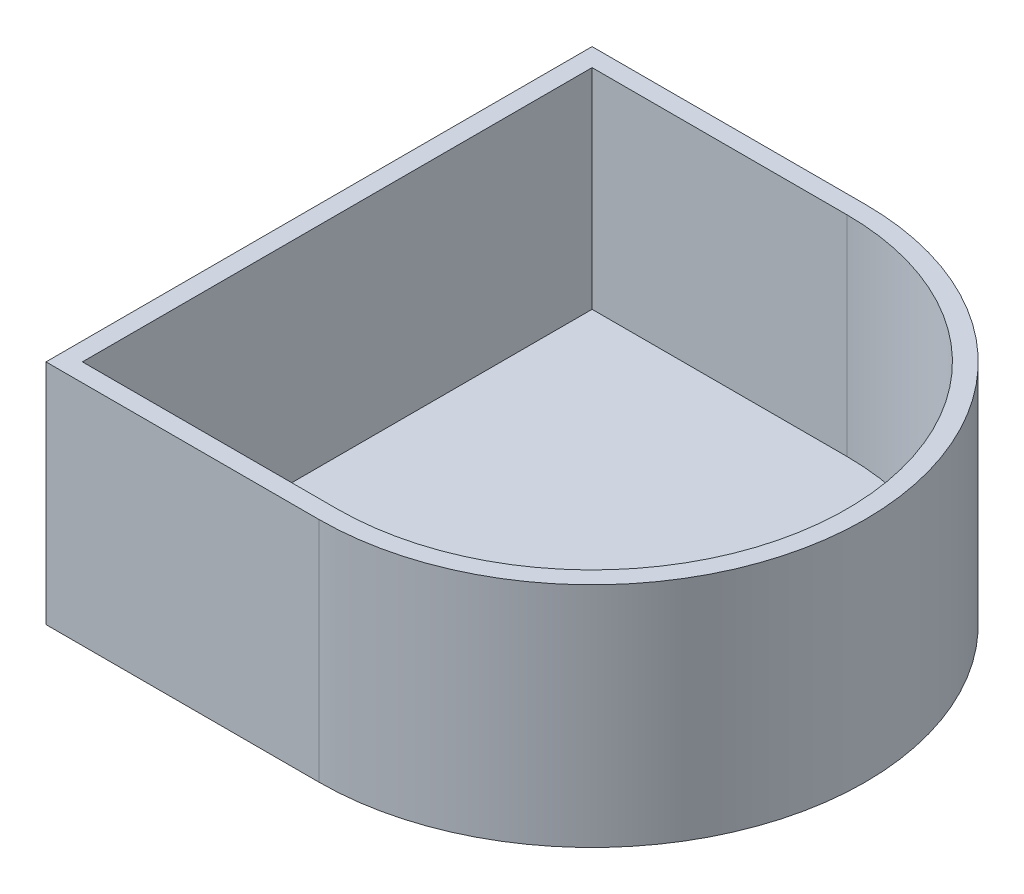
ISO-10303-21;
HEADER;
FILE_DESCRIPTION(('STEP AP214'),'2;1');
FILE_NAME('part.step','',(''),(''),'','','');
FILE_SCHEMA(('AUTOMOTIVE_DESIGN { 1 0 10303 214 1 1 1 1 }'));
ENDSEC;
DATA;
#1=APPLICATION_CONTEXT('core data for automotive mechanical design processes');
#2=APPLICATION_PROTOCOL_DEFINITION('international standard','automotive_design',2000,#1);
#3=PRODUCT_CONTEXT('',#1,'mechanical');
#4=PRODUCT('Part','Part','',(#3));
#5=PRODUCT_RELATED_PRODUCT_CATEGORY('part','',(#4));
#6=PRODUCT_DEFINITION_FORMATION('','',#4);
#7=PRODUCT_DEFINITION_CONTEXT('part definition',#1,'design');
#8=PRODUCT_DEFINITION('design','',#6,#7);
#9=PRODUCT_DEFINITION_SHAPE('','',#8);
#10=(LENGTH_UNIT() NAMED_UNIT(*) SI_UNIT(.MILLI.,.METRE.));
#11=(NAMED_UNIT(*) PLANE_ANGLE_UNIT() SI_UNIT($,.RADIAN.));
#12=(NAMED_UNIT(*) SI_UNIT($,.STERADIAN.) SOLID_ANGLE_UNIT());
#13=UNCERTAINTY_MEASURE_WITH_UNIT(LENGTH_MEASURE(1.E-05),#10,'distance_accuracy_value','');
#14=(GEOMETRIC_REPRESENTATION_CONTEXT(3) GLOBAL_UNCERTAINTY_ASSIGNED_CONTEXT((#13)) GLOBAL_UNIT_ASSIGNED_CONTEXT((#10,
#11,#12)) REPRESENTATION_CONTEXT('',''));
#15=CARTESIAN_POINT('',(0.,0.,0.));
#16=DIRECTION('',(0.,0.,1.));
#17=DIRECTION('',(1.,0.,0.));
#18=AXIS2_PLACEMENT_3D('',#15,#16,#17);
#19=CARTESIAN_POINT('',(-15.,25.,30.));
#20=DIRECTION('',(1.,0.,0.));
#21=DIRECTION('',(0.,0.,-1.));
#22=AXIS2_PLACEMENT_3D('',#19,#20,#21);
#23=PLANE('',#22);
#24=DIRECTION('',(0.,0.,1.));
#25=VECTOR('',#24,1.);
#26=CARTESIAN_POINT('',(-15.,0.,30.));
#27=LINE('',#26,#25);
#28=CARTESIAN_POINT('',(-15.,0.,-30.));
#29=VERTEX_POINT('',#28);
#30=CARTESIAN_POINT('',(-15.,0.,30.));
#31=VERTEX_POINT('',#30);
#32=EDGE_CURVE('E133',#29,#31,#27,.T.);
#33=ORIENTED_EDGE('',*,*,#32,.T.);
#34=DIRECTION('',(0.,-1.,0.));
#35=VECTOR('',#34,1.);
#36=CARTESIAN_POINT('',(-15.,25.,30.));
#37=LINE('',#36,#35);
#38=CARTESIAN_POINT('',(-15.,25.,30.));
#39=VERTEX_POINT('',#38);
#40=EDGE_CURVE('E11',#39,#31,#37,.T.);
#41=ORIENTED_EDGE('',*,*,#40,.F.);
#42=DIRECTION('',(0.,0.,1.));
#43=VECTOR('',#42,1.);
#44=CARTESIAN_POINT('',(-15.,25.,30.));
#45=LINE('',#44,#43);
#46=CARTESIAN_POINT('',(-15.,25.,-30.));
#47=VERTEX_POINT('',#46);
#48=EDGE_CURVE('E142',#47,#39,#45,.T.);
#49=ORIENTED_EDGE('',*,*,#48,.F.);
#50=DIRECTION('',(0.,-1.,0.));
#51=VECTOR('',#50,1.);
#52=CARTESIAN_POINT('',(-15.,25.,-30.));
#53=LINE('',#52,#51);
#54=EDGE_CURVE('E149',#47,#29,#53,.T.);
#55=ORIENTED_EDGE('',*,*,#54,.T.);
#56=EDGE_LOOP('',(#33,#41,#49,#55));
#57=FACE_BOUND('',#56,.T.);
#58=ADVANCED_FACE('F34',(#57),#23,.F.);
#59=CARTESIAN_POINT('',(-15.,25.,30.));
#60=DIRECTION('',(0.,0.,-1.));
#61=DIRECTION('',(-1.,0.,0.));
#62=AXIS2_PLACEMENT_3D('',#59,#60,#61);
#63=PLANE('',#62);
#64=DIRECTION('',(1.,0.,0.));
#65=VECTOR('',#64,1.);
#66=CARTESIAN_POINT('',(-15.,0.,30.));
#67=LINE('',#66,#65);
#68=CARTESIAN_POINT('',(15.,0.,30.));
#69=VERTEX_POINT('',#68);
#70=EDGE_CURVE('E136',#31,#69,#67,.T.);
#71=ORIENTED_EDGE('',*,*,#70,.T.);
#72=DIRECTION('',(0.,-1.,0.));
#73=VECTOR('',#72,1.);
#74=CARTESIAN_POINT('',(15.,25.,30.));
#75=LINE('',#74,#73);
#76=CARTESIAN_POINT('',(15.,25.,30.));
#77=VERTEX_POINT('',#76);
#78=EDGE_CURVE('E41',#77,#69,#75,.T.);
#79=ORIENTED_EDGE('',*,*,#78,.F.);
#80=DIRECTION('',(1.,0.,0.));
#81=VECTOR('',#80,1.);
#82=CARTESIAN_POINT('',(-15.,25.,30.));
#83=LINE('',#82,#81);
#84=EDGE_CURVE('E144',#39,#77,#83,.T.);
#85=ORIENTED_EDGE('',*,*,#84,.F.);
#86=ORIENTED_EDGE('',*,*,#40,.T.);
#87=EDGE_LOOP('',(#71,#79,#85,#86));
#88=FACE_BOUND('',#87,.T.);
#89=ADVANCED_FACE('F172',(#88),#63,.F.);
#90=CARTESIAN_POINT('',(15.,25.,0.));
#91=DIRECTION('',(0.,-1.,0.));
#92=DIRECTION('',(0.,0.,-1.));
#93=AXIS2_PLACEMENT_3D('',#90,#91,#92);
#94=CYLINDRICAL_SURFACE('',#93,30.);
#95=CARTESIAN_POINT('',(15.,0.,0.));
#96=DIRECTION('',(0.,1.,0.));
#97=DIRECTION('',(0.,0.,1.));
#98=AXIS2_PLACEMENT_3D('',#95,#96,#97);
#99=CIRCLE('',#98,30.);
#100=CARTESIAN_POINT('',(15.,0.,-30.));
#101=VERTEX_POINT('',#100);
#102=EDGE_CURVE('E138',#69,#101,#99,.T.);
#103=ORIENTED_EDGE('',*,*,#102,.T.);
#104=DIRECTION('',(0.,-1.,0.));
#105=VECTOR('',#104,1.);
#106=CARTESIAN_POINT('',(15.,25.,-30.));
#107=LINE('',#106,#105);
#108=CARTESIAN_POINT('',(15.,25.,-30.));
#109=VERTEX_POINT('',#108);
#110=EDGE_CURVE('E152',#109,#101,#107,.T.);
#111=ORIENTED_EDGE('',*,*,#110,.F.);
#112=CARTESIAN_POINT('',(15.,25.,0.));
#113=DIRECTION('',(0.,1.,0.));
#114=DIRECTION('',(0.,0.,1.));
#115=AXIS2_PLACEMENT_3D('',#112,#113,#114);
#116=CIRCLE('',#115,30.);
#117=EDGE_CURVE('E146',#77,#109,#116,.T.);
#118=ORIENTED_EDGE('',*,*,#117,.F.);
#119=ORIENTED_EDGE('',*,*,#78,.T.);
#120=EDGE_LOOP('',(#103,#111,#118,#119));
#121=FACE_BOUND('',#120,.T.);
#122=ADVANCED_FACE('F159',(#121),#94,.T.);
#123=CARTESIAN_POINT('',(-15.,25.,-30.));
#124=DIRECTION('',(0.,0.,1.));
#125=DIRECTION('',(1.,0.,0.));
#126=AXIS2_PLACEMENT_3D('',#123,#124,#125);
#127=PLANE('',#126);
#128=DIRECTION('',(-1.,0.,0.));
#129=VECTOR('',#128,1.);
#130=CARTESIAN_POINT('',(-15.,0.,-30.));
#131=LINE('',#130,#129);
#132=EDGE_CURVE('E140',#101,#29,#131,.T.);
#133=ORIENTED_EDGE('',*,*,#132,.T.);
#134=ORIENTED_EDGE('',*,*,#54,.F.);
#135=DIRECTION('',(-1.,0.,0.));
#136=VECTOR('',#135,1.);
#137=CARTESIAN_POINT('',(-15.,25.,-30.));
#138=LINE('',#137,#136);
#139=EDGE_CURVE('E56',#109,#47,#138,.T.);
#140=ORIENTED_EDGE('',*,*,#139,.F.);
#141=ORIENTED_EDGE('',*,*,#110,.T.);
#142=EDGE_LOOP('',(#133,#134,#140,#141));
#143=FACE_BOUND('',#142,.T.);
#144=ADVANCED_FACE('F167',(#143),#127,.F.);
#145=CARTESIAN_POINT('',(15.,25.,0.));
#146=DIRECTION('',(0.,1.,0.));
#147=DIRECTION('',(0.,0.,1.));
#148=AXIS2_PLACEMENT_3D('',#145,#146,#147);
#149=PLANE('',#148);
#150=DIRECTION('',(0.,0.,1.));
#151=VECTOR('',#150,1.);
#152=CARTESIAN_POINT('',(-13.,25.,30.));
#153=LINE('',#152,#151);
#154=CARTESIAN_POINT('',(-13.,25.,-28.));
#155=VERTEX_POINT('',#154);
#156=CARTESIAN_POINT('',(-13.,25.,28.));
#157=VERTEX_POINT('',#156);
#158=EDGE_CURVE('E122',#155,#157,#153,.T.);
#159=ORIENTED_EDGE('',*,*,#158,.F.);
#160=DIRECTION('',(-1.,0.,0.));
#161=VECTOR('',#160,1.);
#162=CARTESIAN_POINT('',(-15.,25.,-28.));
#163=LINE('',#162,#161);
#164=CARTESIAN_POINT('',(15.,25.,-28.));
#165=VERTEX_POINT('',#164);
#166=EDGE_CURVE('E131',#165,#155,#163,.T.);
#167=ORIENTED_EDGE('',*,*,#166,.F.);
#168=CARTESIAN_POINT('',(15.,25.,0.));
#169=DIRECTION('',(0.,1.,0.));
#170=DIRECTION('',(0.,0.,1.));
#171=AXIS2_PLACEMENT_3D('',#168,#169,#170);
#172=CIRCLE('',#171,28.);
#173=CARTESIAN_POINT('',(15.,25.,28.));
#174=VERTEX_POINT('',#173);
#175=EDGE_CURVE('E129',#174,#165,#172,.T.);
#176=ORIENTED_EDGE('',*,*,#175,.F.);
#177=DIRECTION('',(1.,0.,0.));
#178=VECTOR('',#177,1.);
#179=CARTESIAN_POINT('',(-15.,25.,28.));
#180=LINE('',#179,#178);
#181=EDGE_CURVE('E114',#157,#174,#180,.T.);
#182=ORIENTED_EDGE('',*,*,#181,.F.);
#183=EDGE_LOOP('',(#159,#167,#176,#182));
#184=FACE_BOUND('',#183,.T.);
#185=ORIENTED_EDGE('',*,*,#48,.T.);
#186=ORIENTED_EDGE('',*,*,#84,.T.);
#187=ORIENTED_EDGE('',*,*,#117,.T.);
#188=ORIENTED_EDGE('',*,*,#139,.T.);
#189=EDGE_LOOP('',(#185,#186,#187,#188));
#190=FACE_BOUND('',#189,.T.);
#191=ADVANCED_FACE('F171',(#184,#190),#149,.T.);
#192=CARTESIAN_POINT('',(15.,0.,0.));
#193=DIRECTION('',(0.,1.,0.));
#194=DIRECTION('',(0.,0.,1.));
#195=AXIS2_PLACEMENT_3D('',#192,#193,#194);
#196=PLANE('',#195);
#197=ORIENTED_EDGE('',*,*,#32,.F.);
#198=ORIENTED_EDGE('',*,*,#132,.F.);
#199=ORIENTED_EDGE('',*,*,#102,.F.);
#200=ORIENTED_EDGE('',*,*,#70,.F.);
#201=EDGE_LOOP('',(#197,#198,#199,#200));
#202=FACE_BOUND('',#201,.T.);
#203=ADVANCED_FACE('F165',(#202),#196,.F.);
#204=CARTESIAN_POINT('',(-13.,25.,30.));
#205=DIRECTION('',(1.,0.,0.));
#206=DIRECTION('',(0.,0.,-1.));
#207=AXIS2_PLACEMENT_3D('',#204,#205,#206);
#208=PLANE('',#207);
#209=DIRECTION('',(0.,0.,1.));
#210=VECTOR('',#209,1.);
#211=CARTESIAN_POINT('',(-13.,2.,30.));
#212=LINE('',#211,#210);
#213=CARTESIAN_POINT('',(-13.,2.,-28.));
#214=VERTEX_POINT('',#213);
#215=CARTESIAN_POINT('',(-13.,2.,28.));
#216=VERTEX_POINT('',#215);
#217=EDGE_CURVE('E105',#214,#216,#212,.T.);
#218=ORIENTED_EDGE('',*,*,#217,.F.);
#219=DIRECTION('',(0.,-1.,0.));
#220=VECTOR('',#219,1.);
#221=CARTESIAN_POINT('',(-13.,25.,-28.));
#222=LINE('',#221,#220);
#223=EDGE_CURVE('E125',#155,#214,#222,.T.);
#224=ORIENTED_EDGE('',*,*,#223,.F.);
#225=ORIENTED_EDGE('',*,*,#158,.T.);
#226=DIRECTION('',(0.,-1.,0.));
#227=VECTOR('',#226,1.);
#228=CARTESIAN_POINT('',(-13.,25.,28.));
#229=LINE('',#228,#227);
#230=EDGE_CURVE('E117',#157,#216,#229,.T.);
#231=ORIENTED_EDGE('',*,*,#230,.T.);
#232=EDGE_LOOP('',(#218,#224,#225,#231));
#233=FACE_BOUND('',#232,.T.);
#234=ADVANCED_FACE('F187',(#233),#208,.T.);
#235=CARTESIAN_POINT('',(-15.,25.,28.));
#236=DIRECTION('',(0.,0.,-1.));
#237=DIRECTION('',(-1.,0.,0.));
#238=AXIS2_PLACEMENT_3D('',#235,#236,#237);
#239=PLANE('',#238);
#240=DIRECTION('',(1.,0.,0.));
#241=VECTOR('',#240,1.);
#242=CARTESIAN_POINT('',(-15.,2.,28.));
#243=LINE('',#242,#241);
#244=CARTESIAN_POINT('',(15.,2.,28.));
#245=VERTEX_POINT('',#244);
#246=EDGE_CURVE('E99',#216,#245,#243,.T.);
#247=ORIENTED_EDGE('',*,*,#246,.F.);
#248=ORIENTED_EDGE('',*,*,#230,.F.);
#249=ORIENTED_EDGE('',*,*,#181,.T.);
#250=DIRECTION('',(0.,-1.,0.));
#251=VECTOR('',#250,1.);
#252=CARTESIAN_POINT('',(15.,25.,28.));
#253=LINE('',#252,#251);
#254=EDGE_CURVE('E111',#174,#245,#253,.T.);
#255=ORIENTED_EDGE('',*,*,#254,.T.);
#256=EDGE_LOOP('',(#247,#248,#249,#255));
#257=FACE_BOUND('',#256,.T.);
#258=ADVANCED_FACE('F112',(#257),#239,.T.);
#259=CARTESIAN_POINT('',(15.,25.,0.));
#260=DIRECTION('',(0.,-1.,0.));
#261=DIRECTION('',(0.,0.,-1.));
#262=AXIS2_PLACEMENT_3D('',#259,#260,#261);
#263=CYLINDRICAL_SURFACE('',#262,28.);
#264=CARTESIAN_POINT('',(15.,2.,0.));
#265=DIRECTION('',(0.,1.,0.));
#266=DIRECTION('',(0.,0.,1.));
#267=AXIS2_PLACEMENT_3D('',#264,#265,#266);
#268=CIRCLE('',#267,28.);
#269=CARTESIAN_POINT('',(15.,2.,-28.));
#270=VERTEX_POINT('',#269);
#271=EDGE_CURVE('E103',#245,#270,#268,.T.);
#272=ORIENTED_EDGE('',*,*,#271,.F.);
#273=ORIENTED_EDGE('',*,*,#254,.F.);
#274=ORIENTED_EDGE('',*,*,#175,.T.);
#275=DIRECTION('',(0.,1.,0.));
#276=VECTOR('',#275,1.);
#277=CARTESIAN_POINT('',(15.,25.,-28.));
#278=LINE('',#277,#276);
#279=EDGE_CURVE('E48',#165,#270,#278,.F.);
#280=ORIENTED_EDGE('',*,*,#279,.T.);
#281=EDGE_LOOP('',(#272,#273,#274,#280));
#282=FACE_BOUND('',#281,.T.);
#283=ADVANCED_FACE('F119',(#282),#263,.F.);
#284=CARTESIAN_POINT('',(-15.,25.,-28.));
#285=DIRECTION('',(0.,0.,1.));
#286=DIRECTION('',(1.,0.,0.));
#287=AXIS2_PLACEMENT_3D('',#284,#285,#286);
#288=PLANE('',#287);
#289=DIRECTION('',(-1.,0.,0.));
#290=VECTOR('',#289,1.);
#291=CARTESIAN_POINT('',(-15.,2.,-28.));
#292=LINE('',#291,#290);
#293=EDGE_CURVE('E120',#270,#214,#292,.T.);
#294=ORIENTED_EDGE('',*,*,#293,.F.);
#295=ORIENTED_EDGE('',*,*,#279,.F.);
#296=ORIENTED_EDGE('',*,*,#166,.T.);
#297=ORIENTED_EDGE('',*,*,#223,.T.);
#298=EDGE_LOOP('',(#294,#295,#296,#297));
#299=FACE_BOUND('',#298,.T.);
#300=ADVANCED_FACE('F190',(#299),#288,.T.);
#301=CARTESIAN_POINT('',(15.,2.,0.));
#302=DIRECTION('',(0.,1.,0.));
#303=DIRECTION('',(0.,0.,1.));
#304=AXIS2_PLACEMENT_3D('',#301,#302,#303);
#305=PLANE('',#304);
#306=ORIENTED_EDGE('',*,*,#217,.T.);
#307=ORIENTED_EDGE('',*,*,#246,.T.);
#308=ORIENTED_EDGE('',*,*,#271,.T.);
#309=ORIENTED_EDGE('',*,*,#293,.T.);
#310=EDGE_LOOP('',(#306,#307,#308,#309));
#311=FACE_BOUND('',#310,.T.);
#312=ADVANCED_FACE('F101',(#311),#305,.T.);
#313=CLOSED_SHELL('',(#58,#89,#122,#144,#191,#203,#234,#258,#283,#300,#312));
#314=MANIFOLD_SOLID_BREP('B2',#313);
#315=ADVANCED_BREP_SHAPE_REPRESENTATION('',(#18,#314),#14);
#316=SHAPE_DEFINITION_REPRESENTATION(#9,#315);
ENDSEC;
END-ISO-10303-21;
